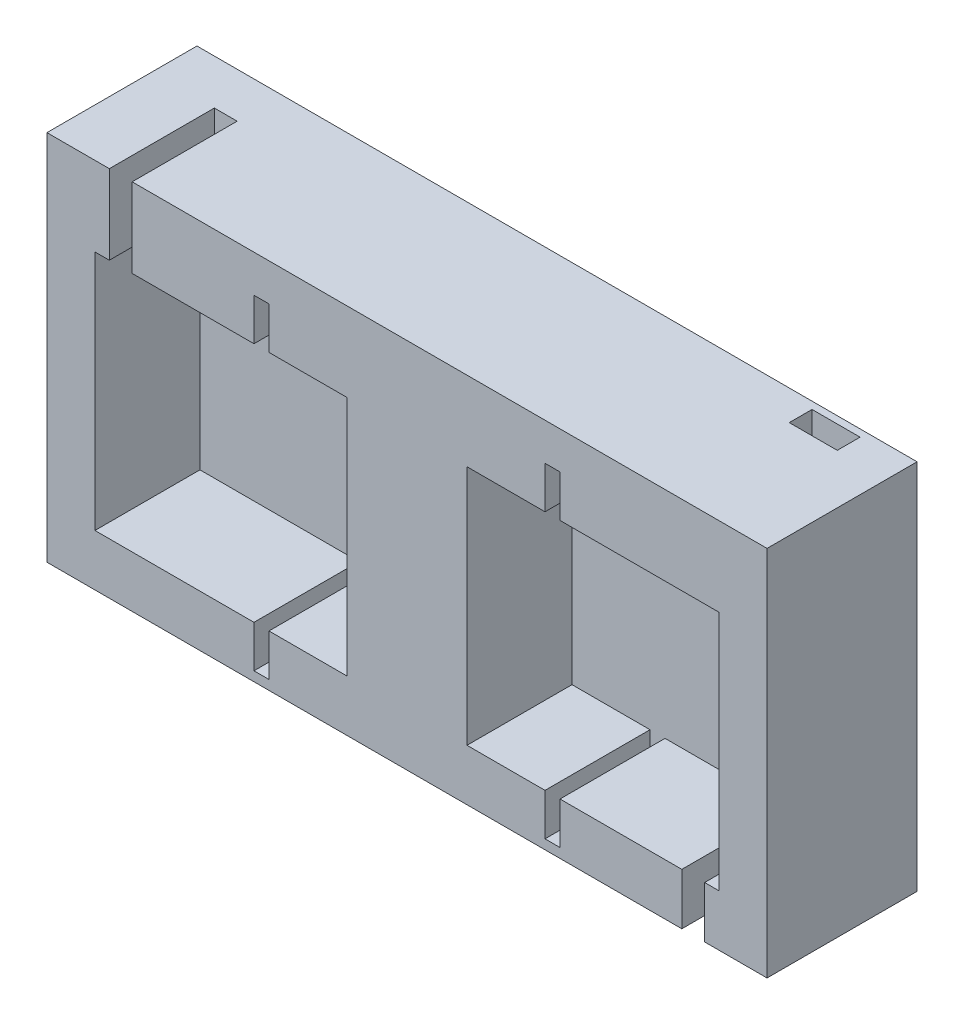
from build123d import *

# Parameters (mm, degrees)
SKETCH1_W               = 120
SKETCH1_H               = 62
BOSS_EXTRUDE1_DEPTH     = 12.5
CUT_EXTRUDE1_DEPTH      = 69.682239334
CUT_EXTRUDE1_DEPTH_BACK = 5
SKETCH1_6_W             = 15
SKETCH1_6_H             = 5
BOSS_EXTRUDE2_DEPTH     = 5
SKETCH2_W               = 8
SKETCH2_H               = 62
CUT_EXTRUDE2_DEPTH      = 5
SKETCH3_W               = 8
SKETCH3_H               = 62
BOSS_EXTRUDE3_DEPTH     = 1.2


with BuildPart() as part:
    # Sketch1 → Boss-Extrude1 (new, symmetric)
    with BuildSketch(Plane.XY):
        Rectangle(SKETCH1_W, SKETCH1_H)
    extrude(amount=BOSS_EXTRUDE1_DEPTH, both=True)

    # Sketch1_5 → Cut-Extrude1 (cut, two sides: drawn at the far end of the back side and taken through both)
    with BuildSketch(Plane.XY.offset(-CUT_EXTRUDE1_DEPTH_BACK)):
        Polygon((45.8, -22.417492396), (45.8, -31), (49.6, -31), (49.6, -22.417492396), (52, -22.417492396), (52, 17.782507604), (25.5, 17.782507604), (25.5, 24.782507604), (23, 24.782507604), (23, 17.782507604), (10, 17.782507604), (10, -22.417492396), (23, -22.417492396), (23, -29.417492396), (25.5, -29.417492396), (25.5, -22.417492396), align=None)
        Polygon((-45.8, 31), (-49.6, 31), (-49.6, 17.782507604), (-52, 17.782507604), (-52, -22.417492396), (-25.5, -22.417492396), (-25.5, -29.417492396), (-23, -29.417492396), (-23, -22.417492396), (-10, -22.417492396), (-10, 17.782507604), (-23, 17.782507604), (-23, 24.782507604), (-25.5, 24.782507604), (-25.5, 17.782507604), (-45.8, 17.782507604), align=None)
    extrude(amount=CUT_EXTRUDE1_DEPTH + CUT_EXTRUDE1_DEPTH_BACK, mode=Mode.SUBTRACT)

    # Sketch1_6 → Boss-Extrude2 (add)
    with BuildSketch(Plane.XY):
        with Locations((0, -33.5)):
            Rectangle(SKETCH1_6_W, SKETCH1_6_H)
    extrude(amount=BOSS_EXTRUDE2_DEPTH)

    # Sketch2 → Cut-Extrude2 (cut)
    with BuildSketch(Plane(origin=(0, 0, -12.5), x_dir=(-1, 0, 0), z_dir=(0, 0, -1))):
        with Locations((-47.7, 0)):
            Rectangle(SKETCH2_W, SKETCH2_H)
    extrude(amount=-CUT_EXTRUDE2_DEPTH, mode=Mode.SUBTRACT)

    # Sketch3 → Boss-Extrude3 (add)
    with BuildSketch(Plane(origin=(0, 0, -12.5), x_dir=(-1, 0, 0), z_dir=(0, 0, -1))):
        with Locations((-47.7, 0)):
            Rectangle(SKETCH3_W, SKETCH3_H)
    extrude(amount=-BOSS_EXTRUDE3_DEPTH)


solid = part.part
